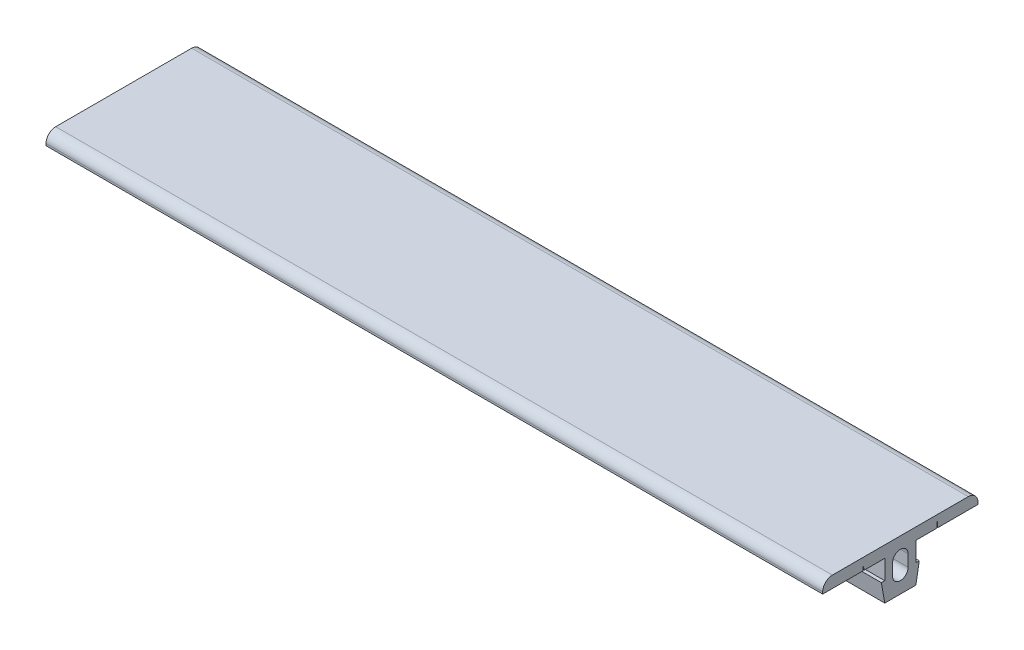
from build123d import *

# Parameters (mm, degrees)
SUOJAKUMIT_1_6028_SUOJAKUMI_NBR_1_DEPTH = 200


with BuildPart() as part:
    # Sketch1 → Suojakumit 1.6028 SUOJAKUMI NBR_1 (new body)
    with BuildSketch(Plane(origin=(0, 0, 0), x_dir=(0, 0, -1), z_dir=(1, 0, 0))):
        with BuildLine():
            Line((9.631103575, 3.434447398), (20.000000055, 3.434447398))
            Line((20.000000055, 3.434447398), (20.000000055, 3.934447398))
            ThreePointArc((20.000000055, 3.934447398), (19.267767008, 5.702214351), (17.500000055, 6.434447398))
            Line((17.500000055, 6.434447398), (-17.499999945, 6.434447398))
            ThreePointArc((-17.499999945, 6.434447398), (-19.267766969, 5.70221439), (-20.000000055, 3.934447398))
            Line((-20.000000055, 3.934447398), (-20.000000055, 3.434447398))
            Line((-20.000000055, 3.434447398), (-9.631103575, 3.434447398))
            Line((-9.631103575, 3.434447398), (-9.500000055, 4.933747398))
            Line((-9.500000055, 4.933747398), (-9.368896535, 3.434447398))
            Line((-9.368896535, 3.434447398), (-4.000000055, 3.434447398))
            Line((-4.000000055, 3.434447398), (-3.999999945, -1.565552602))
            Line((-3.999999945, -1.565552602), (-4.881591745, -1.565552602))
            Line((-4.881591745, -1.565552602), (-3.999999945, -6.565552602))
            Line((-3.999999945, -6.565552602), (4.000000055, -6.565552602))
            Line((4.000000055, -6.565552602), (4.881591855, -1.565552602))
            Line((4.881591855, -1.565552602), (4.000000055, -1.565552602))
            Line((4.000000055, -1.565552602), (4.000000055, 3.434447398))
            Line((4.000000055, 3.434447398), (9.368896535, 3.434447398))
            Line((9.368896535, 3.434447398), (9.500000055, 4.933747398))
            Line((9.500000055, 4.933747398), (9.631103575, 3.434447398))
        make_face()
        with BuildLine():
            Line((1.999999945, -1.565552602), (1.999999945, 1.434447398))
            ThreePointArc((1.999999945, 1.434447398), (-5.5e-08, 3.434447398), (-2.000000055, 1.434447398))
            Line((-2.000000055, 1.434447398), (-2.000000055, -1.565552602))
            ThreePointArc((-2.000000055, -1.565552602), (-5.5e-08, -3.565552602), (1.999999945, -1.565552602))
        make_face(mode=Mode.SUBTRACT)
    extrude(amount=SUOJAKUMIT_1_6028_SUOJAKUMI_NBR_1_DEPTH)


solid = part.part
